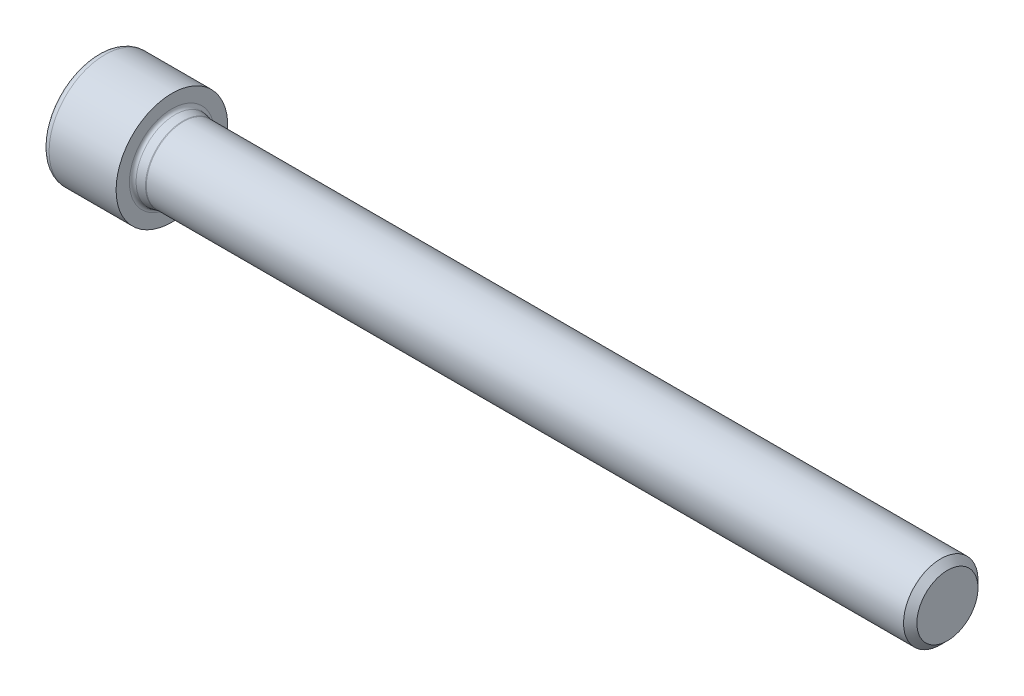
from build123d import *

# Parameters (mm, degrees)
SCHNITT_LINEAR_AUSTRAGEN1_DEPTH = 12


with BuildPart() as part:
    # Skizze1 → Rotation1 (revolve)
    with BuildSketch(Plane(origin=(0, 0, 0), x_dir=(-1, 0, 0), z_dir=(0, 1, 0)), mode=Mode.PRIVATE) as rotation1_sk:
        with BuildLine():
            Line((1.913248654, 0), (4.8, -5))
            Line((4.8, -5), (11.285, -5))
            Line((11.285, -5), (12, -5.715))
            Line((12, -5.715), (12, -7.8))
            ThreePointArc((12, -7.8), (11.648528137, -8.648528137), (10.8, -9))
            Line((10.8, -9), (0, -9))
            Line((0, -9), (0, -6.85))
            ThreePointArc((0, -6.85), (-0.136571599, -6.468904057), (-0.484113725, -6.261297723))
            Line((-0.484113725, -6.261297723), (-1.754113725, -6.011297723))
            ThreePointArc((-1.754113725, -6.011297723), (-1.811782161, -6.00283111), (-1.87, -6))
            Line((-1.87, -6), (-123.9265, -6))
            Line((-123.9265, -6), (-125, -4.9265))
            Line((-125, -4.9265), (-125, 0))
            Line((-125, 0), (1.913248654, 0))
        make_face()
    revolve(rotation1_sk.sketch.rotate(Axis((125, 0, 0), (-1, 0, 0)), 180), axis=Axis((125, 0, 0), (-1, 0, 0)))

    # Skizze2 → Schnitt-Linear austragen1 (cut)
    with BuildSketch(Plane(origin=(-4.8, 0, 0), x_dir=(0, 0, -1), z_dir=(1, 0, 0))):
        Polygon((-5, 2.886751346), (-5, -2.886751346), (0, -5.773502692), (5, -2.886751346), (5, 2.886751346), (0, 5.773502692), align=None)
    extrude(amount=-SCHNITT_LINEAR_AUSTRAGEN1_DEPTH, mode=Mode.SUBTRACT)


solid = part.part
